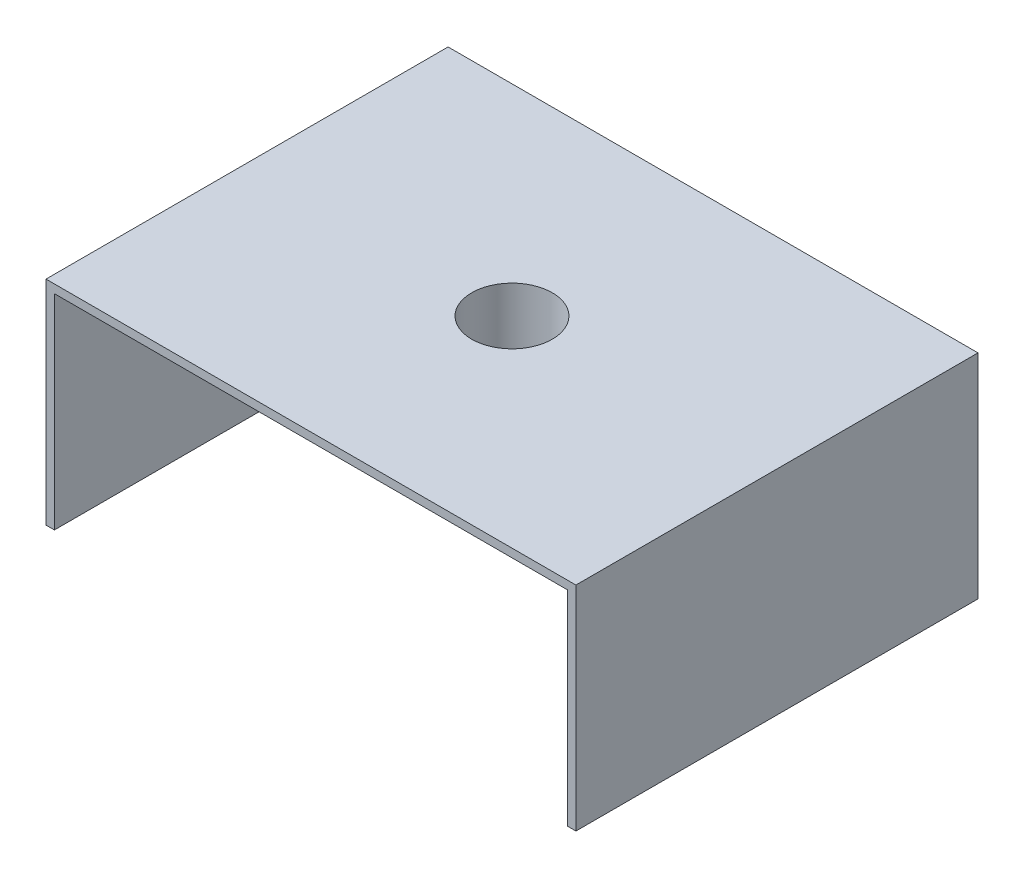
ISO-10303-21;
HEADER;
FILE_DESCRIPTION(('STEP AP214'),'2;1');
FILE_NAME('part.step','',(''),(''),'','','');
FILE_SCHEMA(('AUTOMOTIVE_DESIGN { 1 0 10303 214 1 1 1 1 }'));
ENDSEC;
DATA;
#1=APPLICATION_CONTEXT('core data for automotive mechanical design processes');
#2=APPLICATION_PROTOCOL_DEFINITION('international standard','automotive_design',2000,#1);
#3=PRODUCT_CONTEXT('',#1,'mechanical');
#4=PRODUCT('Part','Part','',(#3));
#5=PRODUCT_RELATED_PRODUCT_CATEGORY('part','',(#4));
#6=PRODUCT_DEFINITION_FORMATION('','',#4);
#7=PRODUCT_DEFINITION_CONTEXT('part definition',#1,'design');
#8=PRODUCT_DEFINITION('design','',#6,#7);
#9=PRODUCT_DEFINITION_SHAPE('','',#8);
#10=(LENGTH_UNIT() NAMED_UNIT(*) SI_UNIT(.MILLI.,.METRE.));
#11=(NAMED_UNIT(*) PLANE_ANGLE_UNIT() SI_UNIT($,.RADIAN.));
#12=(NAMED_UNIT(*) SI_UNIT($,.STERADIAN.) SOLID_ANGLE_UNIT());
#13=UNCERTAINTY_MEASURE_WITH_UNIT(LENGTH_MEASURE(1.E-05),#10,'distance_accuracy_value','');
#14=(GEOMETRIC_REPRESENTATION_CONTEXT(3) GLOBAL_UNCERTAINTY_ASSIGNED_CONTEXT((#13)) GLOBAL_UNIT_ASSIGNED_CONTEXT((#10,
#11,#12)) REPRESENTATION_CONTEXT('',''));
#15=CARTESIAN_POINT('',(0.,0.,0.));
#16=DIRECTION('',(0.,0.,1.));
#17=DIRECTION('',(1.,0.,0.));
#18=AXIS2_PLACEMENT_3D('',#15,#16,#17);
#19=CARTESIAN_POINT('',(94.4989118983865,-3.,-71.7067734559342));
#20=DIRECTION('',(0.,-1.,0.));
#21=DIRECTION('',(0.,0.,-1.));
#22=AXIS2_PLACEMENT_3D('',#19,#20,#21);
#23=PLANE('',#22);
#24=DIRECTION('',(0.,0.,-1.));
#25=VECTOR('',#24,1.);
#26=CARTESIAN_POINT('',(91.4989118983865,-3.,71.7067734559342));
#27=LINE('',#26,#25);
#28=CARTESIAN_POINT('',(91.4989118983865,-3.,71.7067734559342));
#29=VERTEX_POINT('',#28);
#30=CARTESIAN_POINT('',(91.4989118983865,-3.,-68.7067734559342));
#31=VERTEX_POINT('',#30);
#32=EDGE_CURVE('E11',#29,#31,#27,.T.);
#33=ORIENTED_EDGE('',*,*,#32,.F.);
#34=DIRECTION('',(1.,0.,0.));
#35=VECTOR('',#34,1.);
#36=CARTESIAN_POINT('',(-94.4989118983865,-3.,71.7067734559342));
#37=LINE('',#36,#35);
#38=CARTESIAN_POINT('',(-91.4989118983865,-3.,71.7067734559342));
#39=VERTEX_POINT('',#38);
#40=EDGE_CURVE('E117',#39,#29,#37,.T.);
#41=ORIENTED_EDGE('',*,*,#40,.F.);
#42=DIRECTION('',(0.,0.,1.));
#43=VECTOR('',#42,1.);
#44=CARTESIAN_POINT('',(-91.4989118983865,-3.,71.7067734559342));
#45=LINE('',#44,#43);
#46=CARTESIAN_POINT('',(-91.4989118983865,-3.,-68.7067734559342));
#47=VERTEX_POINT('',#46);
#48=EDGE_CURVE('E125',#47,#39,#45,.T.);
#49=ORIENTED_EDGE('',*,*,#48,.F.);
#50=DIRECTION('',(-1.,0.,0.));
#51=VECTOR('',#50,1.);
#52=CARTESIAN_POINT('',(-94.4989118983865,-3.,-68.7067734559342));
#53=LINE('',#52,#51);
#54=EDGE_CURVE('E44',#31,#47,#53,.T.);
#55=ORIENTED_EDGE('',*,*,#54,.F.);
#56=EDGE_LOOP('',(#33,#41,#49,#55));
#57=FACE_BOUND('',#56,.T.);
#58=CARTESIAN_POINT('',(0.,-3.,0.));
#59=DIRECTION('',(0.,-1.,0.));
#60=DIRECTION('',(0.,0.,-1.));
#61=AXIS2_PLACEMENT_3D('',#58,#59,#60);
#62=CIRCLE('',#61,15.8714357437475);
#63=CARTESIAN_POINT('',(0.,-3.,-15.8714357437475));
#64=VERTEX_POINT('',#63);
#65=EDGE_CURVE('E183',#64,#64,#62,.F.);
#66=ORIENTED_EDGE('',*,*,#65,.T.);
#67=EDGE_LOOP('',(#66));
#68=FACE_BOUND('',#67,.T.);
#69=ADVANCED_FACE('F35',(#57,#68),#23,.T.);
#70=CARTESIAN_POINT('',(0.,9.99999999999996,0.));
#71=DIRECTION('',(0.,-1.,0.));
#72=DIRECTION('',(0.,0.,-1.));
#73=AXIS2_PLACEMENT_3D('',#70,#71,#72);
#74=CYLINDRICAL_SURFACE('',#73,14.3714357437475);
#75=CARTESIAN_POINT('',(0.,0.,0.));
#76=DIRECTION('',(0.,1.,0.));
#77=DIRECTION('',(0.,0.,1.));
#78=AXIS2_PLACEMENT_3D('',#75,#76,#77);
#79=CIRCLE('',#78,14.3714357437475);
#80=CARTESIAN_POINT('',(0.,0.,14.3714357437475));
#81=VERTEX_POINT('',#80);
#82=EDGE_CURVE('E39',#81,#81,#79,.T.);
#83=ORIENTED_EDGE('',*,*,#82,.T.);
#84=EDGE_LOOP('',(#83));
#85=FACE_BOUND('',#84,.T.);
#86=CARTESIAN_POINT('',(0.,-56.5,0.));
#87=DIRECTION('',(0.,1.,0.));
#88=DIRECTION('',(0.,0.,1.));
#89=AXIS2_PLACEMENT_3D('',#86,#87,#88);
#90=CIRCLE('',#89,14.3714357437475);
#91=CARTESIAN_POINT('',(0.,-56.5,14.3714357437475));
#92=VERTEX_POINT('',#91);
#93=EDGE_CURVE('E187',#92,#92,#90,.T.);
#94=ORIENTED_EDGE('',*,*,#93,.F.);
#95=EDGE_LOOP('',(#94));
#96=FACE_BOUND('',#95,.T.);
#97=ADVANCED_FACE('F202',(#85,#96),#74,.F.);
#98=CARTESIAN_POINT('',(-94.4989118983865,-76.,-71.7067734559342));
#99=DIRECTION('',(0.,0.,-1.));
#100=DIRECTION('',(-1.,0.,0.));
#101=AXIS2_PLACEMENT_3D('',#98,#99,#100);
#102=PLANE('',#101);
#103=DIRECTION('',(-1.,0.,0.));
#104=VECTOR('',#103,1.);
#105=CARTESIAN_POINT('',(-94.4989118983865,0.,-71.7067734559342));
#106=LINE('',#105,#104);
#107=CARTESIAN_POINT('',(94.4989118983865,0.,-71.7067734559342));
#108=VERTEX_POINT('',#107);
#109=CARTESIAN_POINT('',(-94.4989118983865,0.,-71.7067734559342));
#110=VERTEX_POINT('',#109);
#111=EDGE_CURVE('E166',#108,#110,#106,.T.);
#112=ORIENTED_EDGE('',*,*,#111,.F.);
#113=DIRECTION('',(0.,1.,0.));
#114=VECTOR('',#113,1.);
#115=CARTESIAN_POINT('',(94.4989118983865,-76.,-71.7067734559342));
#116=LINE('',#115,#114);
#117=CARTESIAN_POINT('',(94.4989118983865,-76.,-71.7067734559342));
#118=VERTEX_POINT('',#117);
#119=EDGE_CURVE('E143',#118,#108,#116,.T.);
#120=ORIENTED_EDGE('',*,*,#119,.F.);
#121=DIRECTION('',(-1.,0.,0.));
#122=VECTOR('',#121,1.);
#123=CARTESIAN_POINT('',(-94.4989118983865,-76.,-71.7067734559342));
#124=LINE('',#123,#122);
#125=CARTESIAN_POINT('',(-94.4989118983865,-76.,-71.7067734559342));
#126=VERTEX_POINT('',#125);
#127=EDGE_CURVE('E152',#118,#126,#124,.T.);
#128=ORIENTED_EDGE('',*,*,#127,.T.);
#129=DIRECTION('',(0.,1.,0.));
#130=VECTOR('',#129,1.);
#131=CARTESIAN_POINT('',(-94.4989118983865,-76.,-71.7067734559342));
#132=LINE('',#131,#130);
#133=EDGE_CURVE('E146',#126,#110,#132,.T.);
#134=ORIENTED_EDGE('',*,*,#133,.T.);
#135=EDGE_LOOP('',(#112,#120,#128,#134));
#136=FACE_BOUND('',#135,.T.);
#137=ADVANCED_FACE('F177',(#136),#102,.T.);
#138=CARTESIAN_POINT('',(-94.4989118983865,-76.,71.7067734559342));
#139=DIRECTION('',(-1.,0.,0.));
#140=DIRECTION('',(0.,0.,1.));
#141=AXIS2_PLACEMENT_3D('',#138,#139,#140);
#142=PLANE('',#141);
#143=DIRECTION('',(0.,0.,1.));
#144=VECTOR('',#143,1.);
#145=CARTESIAN_POINT('',(-94.4989118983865,0.,71.7067734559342));
#146=LINE('',#145,#144);
#147=CARTESIAN_POINT('',(-94.4989118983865,0.,71.7067734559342));
#148=VERTEX_POINT('',#147);
#149=EDGE_CURVE('E161',#110,#148,#146,.T.);
#150=ORIENTED_EDGE('',*,*,#149,.F.);
#151=ORIENTED_EDGE('',*,*,#133,.F.);
#152=DIRECTION('',(0.,0.,1.));
#153=VECTOR('',#152,1.);
#154=CARTESIAN_POINT('',(-94.4989118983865,-76.,71.7067734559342));
#155=LINE('',#154,#153);
#156=CARTESIAN_POINT('',(-94.4989118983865,-76.,71.7067734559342));
#157=VERTEX_POINT('',#156);
#158=EDGE_CURVE('E145',#126,#157,#155,.T.);
#159=ORIENTED_EDGE('',*,*,#158,.T.);
#160=DIRECTION('',(0.,1.,0.));
#161=VECTOR('',#160,1.);
#162=CARTESIAN_POINT('',(-94.4989118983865,-76.,71.7067734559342));
#163=LINE('',#162,#161);
#164=EDGE_CURVE('E139',#157,#148,#163,.T.);
#165=ORIENTED_EDGE('',*,*,#164,.T.);
#166=EDGE_LOOP('',(#150,#151,#159,#165));
#167=FACE_BOUND('',#166,.T.);
#168=ADVANCED_FACE('F181',(#167),#142,.T.);
#169=CARTESIAN_POINT('',(94.4989118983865,-76.,71.7067734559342));
#170=DIRECTION('',(1.,0.,0.));
#171=DIRECTION('',(0.,0.,-1.));
#172=AXIS2_PLACEMENT_3D('',#169,#170,#171);
#173=PLANE('',#172);
#174=DIRECTION('',(0.,0.,-1.));
#175=VECTOR('',#174,1.);
#176=CARTESIAN_POINT('',(94.4989118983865,0.,71.7067734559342));
#177=LINE('',#176,#175);
#178=CARTESIAN_POINT('',(94.4989118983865,0.,71.7067734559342));
#179=VERTEX_POINT('',#178);
#180=EDGE_CURVE('E127',#179,#108,#177,.T.);
#181=ORIENTED_EDGE('',*,*,#180,.F.);
#182=DIRECTION('',(0.,1.,0.));
#183=VECTOR('',#182,1.);
#184=CARTESIAN_POINT('',(94.4989118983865,-76.,71.7067734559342));
#185=LINE('',#184,#183);
#186=CARTESIAN_POINT('',(94.4989118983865,-76.,71.7067734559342));
#187=VERTEX_POINT('',#186);
#188=EDGE_CURVE('E169',#187,#179,#185,.T.);
#189=ORIENTED_EDGE('',*,*,#188,.F.);
#190=DIRECTION('',(0.,0.,-1.));
#191=VECTOR('',#190,1.);
#192=CARTESIAN_POINT('',(94.4989118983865,-76.,71.7067734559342));
#193=LINE('',#192,#191);
#194=EDGE_CURVE('E154',#187,#118,#193,.T.);
#195=ORIENTED_EDGE('',*,*,#194,.T.);
#196=ORIENTED_EDGE('',*,*,#119,.T.);
#197=EDGE_LOOP('',(#181,#189,#195,#196));
#198=FACE_BOUND('',#197,.T.);
#199=ADVANCED_FACE('F174',(#198),#173,.T.);
#200=CARTESIAN_POINT('',(94.4989118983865,-76.,-71.7067734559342));
#201=DIRECTION('',(0.,-1.,0.));
#202=DIRECTION('',(0.,0.,-1.));
#203=AXIS2_PLACEMENT_3D('',#200,#201,#202);
#204=PLANE('',#203);
#205=DIRECTION('',(1.,0.,0.));
#206=VECTOR('',#205,1.);
#207=CARTESIAN_POINT('',(-94.4989118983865,-76.,71.7067734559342));
#208=LINE('',#207,#206);
#209=CARTESIAN_POINT('',(91.4989118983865,-76.,71.7067734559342));
#210=VERTEX_POINT('',#209);
#211=EDGE_CURVE('E142',#210,#187,#208,.T.);
#212=ORIENTED_EDGE('',*,*,#211,.F.);
#213=DIRECTION('',(0.,0.,-1.));
#214=VECTOR('',#213,1.);
#215=CARTESIAN_POINT('',(91.4989118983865,-76.,71.7067734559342));
#216=LINE('',#215,#214);
#217=CARTESIAN_POINT('',(91.4989118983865,-76.,-68.7067734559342));
#218=VERTEX_POINT('',#217);
#219=EDGE_CURVE('E115',#210,#218,#216,.T.);
#220=ORIENTED_EDGE('',*,*,#219,.T.);
#221=DIRECTION('',(-1.,0.,0.));
#222=VECTOR('',#221,1.);
#223=CARTESIAN_POINT('',(-94.4989118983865,-76.,-68.7067734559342));
#224=LINE('',#223,#222);
#225=CARTESIAN_POINT('',(-91.4989118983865,-76.,-68.7067734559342));
#226=VERTEX_POINT('',#225);
#227=EDGE_CURVE('E108',#218,#226,#224,.T.);
#228=ORIENTED_EDGE('',*,*,#227,.T.);
#229=DIRECTION('',(0.,0.,1.));
#230=VECTOR('',#229,1.);
#231=CARTESIAN_POINT('',(-91.4989118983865,-76.,71.7067734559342));
#232=LINE('',#231,#230);
#233=CARTESIAN_POINT('',(-91.4989118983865,-76.,71.7067734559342));
#234=VERTEX_POINT('',#233);
#235=EDGE_CURVE('E100',#226,#234,#232,.T.);
#236=ORIENTED_EDGE('',*,*,#235,.T.);
#237=EDGE_CURVE('E137',#157,#234,#208,.T.);
#238=ORIENTED_EDGE('',*,*,#237,.F.);
#239=ORIENTED_EDGE('',*,*,#158,.F.);
#240=ORIENTED_EDGE('',*,*,#127,.F.);
#241=ORIENTED_EDGE('',*,*,#194,.F.);
#242=EDGE_LOOP('',(#212,#220,#228,#236,#238,#239,#240,#241));
#243=FACE_BOUND('',#242,.T.);
#244=ADVANCED_FACE('F114',(#243),#204,.T.);
#245=CARTESIAN_POINT('',(-94.4989118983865,-76.,-68.7067734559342));
#246=DIRECTION('',(0.,0.,-1.));
#247=DIRECTION('',(-1.,0.,0.));
#248=AXIS2_PLACEMENT_3D('',#245,#246,#247);
#249=PLANE('',#248);
#250=ORIENTED_EDGE('',*,*,#54,.T.);
#251=DIRECTION('',(0.,1.,0.));
#252=VECTOR('',#251,1.);
#253=CARTESIAN_POINT('',(-91.4989118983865,-76.,-68.7067734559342));
#254=LINE('',#253,#252);
#255=EDGE_CURVE('E59',#226,#47,#254,.T.);
#256=ORIENTED_EDGE('',*,*,#255,.F.);
#257=ORIENTED_EDGE('',*,*,#227,.F.);
#258=DIRECTION('',(0.,1.,0.));
#259=VECTOR('',#258,1.);
#260=CARTESIAN_POINT('',(91.4989118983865,-76.,-68.7067734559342));
#261=LINE('',#260,#259);
#262=EDGE_CURVE('E51',#218,#31,#261,.T.);
#263=ORIENTED_EDGE('',*,*,#262,.T.);
#264=EDGE_LOOP('',(#250,#256,#257,#263));
#265=FACE_BOUND('',#264,.T.);
#266=ADVANCED_FACE('F110',(#265),#249,.F.);
#267=CARTESIAN_POINT('',(-91.4989118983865,-76.,71.7067734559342));
#268=DIRECTION('',(-1.,0.,0.));
#269=DIRECTION('',(0.,0.,1.));
#270=AXIS2_PLACEMENT_3D('',#267,#268,#269);
#271=PLANE('',#270);
#272=ORIENTED_EDGE('',*,*,#48,.T.);
#273=DIRECTION('',(0.,1.,0.));
#274=VECTOR('',#273,1.);
#275=CARTESIAN_POINT('',(-91.4989118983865,-76.,71.7067734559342));
#276=LINE('',#275,#274);
#277=EDGE_CURVE('E103',#234,#39,#276,.T.);
#278=ORIENTED_EDGE('',*,*,#277,.F.);
#279=ORIENTED_EDGE('',*,*,#235,.F.);
#280=ORIENTED_EDGE('',*,*,#255,.T.);
#281=EDGE_LOOP('',(#272,#278,#279,#280));
#282=FACE_BOUND('',#281,.T.);
#283=ADVANCED_FACE('F101',(#282),#271,.F.);
#284=CARTESIAN_POINT('',(-94.4989118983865,-76.,71.7067734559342));
#285=DIRECTION('',(0.,0.,1.));
#286=DIRECTION('',(1.,0.,0.));
#287=AXIS2_PLACEMENT_3D('',#284,#285,#286);
#288=PLANE('',#287);
#289=ORIENTED_EDGE('',*,*,#237,.T.);
#290=ORIENTED_EDGE('',*,*,#277,.T.);
#291=ORIENTED_EDGE('',*,*,#40,.T.);
#292=DIRECTION('',(0.,1.,0.));
#293=VECTOR('',#292,1.);
#294=CARTESIAN_POINT('',(91.4989118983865,-76.,71.7067734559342));
#295=LINE('',#294,#293);
#296=EDGE_CURVE('E122',#210,#29,#295,.T.);
#297=ORIENTED_EDGE('',*,*,#296,.F.);
#298=ORIENTED_EDGE('',*,*,#211,.T.);
#299=ORIENTED_EDGE('',*,*,#188,.T.);
#300=DIRECTION('',(1.,0.,0.));
#301=VECTOR('',#300,1.);
#302=CARTESIAN_POINT('',(-94.4989118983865,0.,71.7067734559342));
#303=LINE('',#302,#301);
#304=EDGE_CURVE('E156',#148,#179,#303,.T.);
#305=ORIENTED_EDGE('',*,*,#304,.F.);
#306=ORIENTED_EDGE('',*,*,#164,.F.);
#307=EDGE_LOOP('',(#289,#290,#291,#297,#298,#299,#305,#306));
#308=FACE_BOUND('',#307,.T.);
#309=ADVANCED_FACE('F136',(#308),#288,.T.);
#310=CARTESIAN_POINT('',(91.4989118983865,-76.,71.7067734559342));
#311=DIRECTION('',(1.,0.,0.));
#312=DIRECTION('',(0.,0.,-1.));
#313=AXIS2_PLACEMENT_3D('',#310,#311,#312);
#314=PLANE('',#313);
#315=ORIENTED_EDGE('',*,*,#32,.T.);
#316=ORIENTED_EDGE('',*,*,#262,.F.);
#317=ORIENTED_EDGE('',*,*,#219,.F.);
#318=ORIENTED_EDGE('',*,*,#296,.T.);
#319=EDGE_LOOP('',(#315,#316,#317,#318));
#320=FACE_BOUND('',#319,.T.);
#321=ADVANCED_FACE('F210',(#320),#314,.F.);
#322=CARTESIAN_POINT('',(94.4989118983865,0.,-71.7067734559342));
#323=DIRECTION('',(0.,-1.,0.));
#324=DIRECTION('',(0.,0.,-1.));
#325=AXIS2_PLACEMENT_3D('',#322,#323,#324);
#326=PLANE('',#325);
#327=ORIENTED_EDGE('',*,*,#82,.F.);
#328=EDGE_LOOP('',(#327));
#329=FACE_BOUND('',#328,.T.);
#330=ORIENTED_EDGE('',*,*,#180,.T.);
#331=ORIENTED_EDGE('',*,*,#111,.T.);
#332=ORIENTED_EDGE('',*,*,#149,.T.);
#333=ORIENTED_EDGE('',*,*,#304,.T.);
#334=EDGE_LOOP('',(#330,#331,#332,#333));
#335=FACE_BOUND('',#334,.T.);
#336=ADVANCED_FACE('F37',(#329,#335),#326,.F.);
#337=CARTESIAN_POINT('',(0.,-58.,0.));
#338=DIRECTION('',(0.,1.,0.));
#339=DIRECTION('',(0.,0.,1.));
#340=AXIS2_PLACEMENT_3D('',#337,#338,#339);
#341=PLANE('',#340);
#342=CARTESIAN_POINT('',(0.,-58.,0.));
#343=DIRECTION('',(0.,1.,0.));
#344=DIRECTION('',(0.,0.,1.));
#345=AXIS2_PLACEMENT_3D('',#342,#343,#344);
#346=CIRCLE('',#345,15.8714357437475);
#347=CARTESIAN_POINT('',(0.,-58.,15.8714357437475));
#348=VERTEX_POINT('',#347);
#349=EDGE_CURVE('E191',#348,#348,#346,.T.);
#350=ORIENTED_EDGE('',*,*,#349,.F.);
#351=EDGE_LOOP('',(#350));
#352=FACE_BOUND('',#351,.T.);
#353=ADVANCED_FACE('F199',(#352),#341,.F.);
#354=CARTESIAN_POINT('',(0.,9.99999999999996,0.));
#355=DIRECTION('',(0.,-1.,0.));
#356=DIRECTION('',(0.,0.,-1.));
#357=AXIS2_PLACEMENT_3D('',#354,#355,#356);
#358=CYLINDRICAL_SURFACE('',#357,15.8714357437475);
#359=ORIENTED_EDGE('',*,*,#65,.F.);
#360=EDGE_LOOP('',(#359));
#361=FACE_BOUND('',#360,.T.);
#362=ORIENTED_EDGE('',*,*,#349,.T.);
#363=EDGE_LOOP('',(#362));
#364=FACE_BOUND('',#363,.T.);
#365=ADVANCED_FACE('F197',(#361,#364),#358,.T.);
#366=CARTESIAN_POINT('',(0.,-56.5,0.));
#367=DIRECTION('',(0.,1.,0.));
#368=DIRECTION('',(0.,0.,1.));
#369=AXIS2_PLACEMENT_3D('',#366,#367,#368);
#370=PLANE('',#369);
#371=ORIENTED_EDGE('',*,*,#93,.T.);
#372=EDGE_LOOP('',(#371));
#373=FACE_BOUND('',#372,.T.);
#374=ADVANCED_FACE('F207',(#373),#370,.T.);
#375=CLOSED_SHELL('',(#69,#97,#137,#168,#199,#244,#266,#283,#309,#321,#336,#353,#365,#374));
#376=MANIFOLD_SOLID_BREP('B2',#375);
#377=ADVANCED_BREP_SHAPE_REPRESENTATION('',(#18,#376),#14);
#378=SHAPE_DEFINITION_REPRESENTATION(#9,#377);
ENDSEC;
END-ISO-10303-21;
